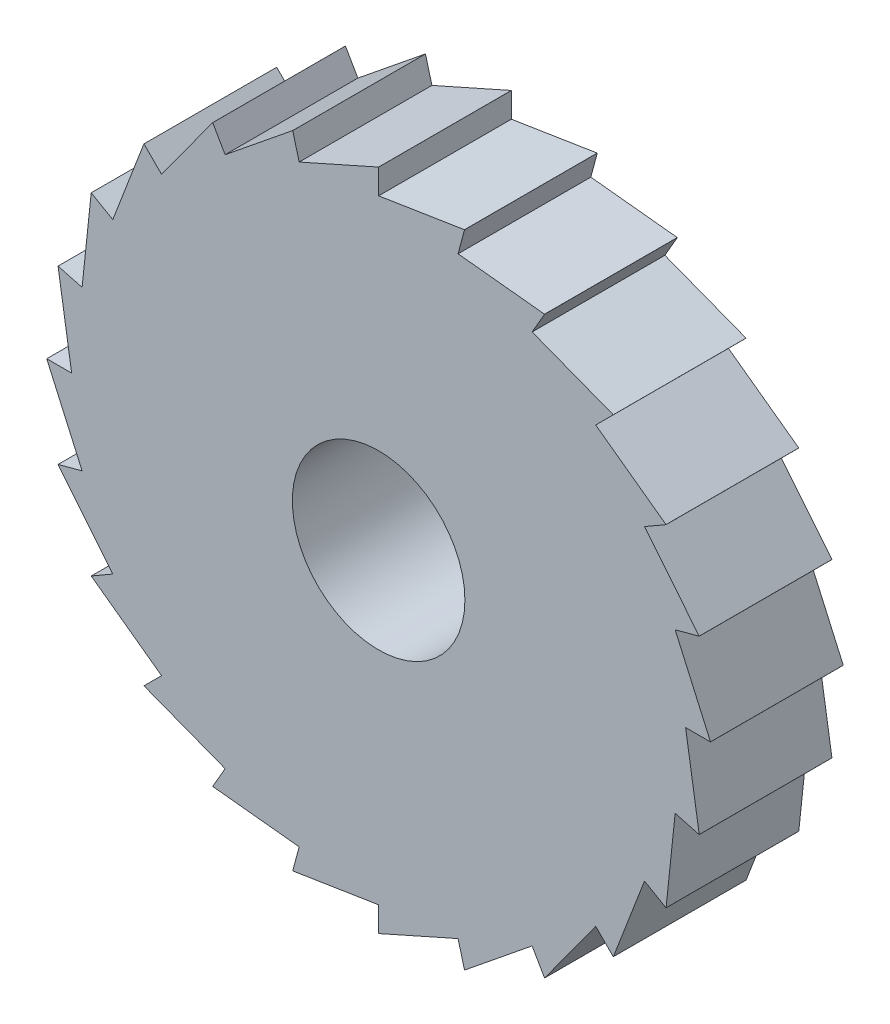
from build123d import *

# Parameters (mm, degrees)
SKETCH_2_R      = 6.5
EXTRUDE_2_DEPTH = 10


with BuildPart() as part:
    # Sketch 2 → Extrude 2 (new body)
    with BuildSketch(Plane.XY):
        with BuildLine():
            Line((0, 25), (0, 23.125))
            Line((0, 23.125), (6.466541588, 24.14919957))
            ThreePointArc((6.466541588, 24.14919957), (6.468508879, 24.148672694), (6.470476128, 24.148145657))
            Line((6.470476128, 24.148145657), (5.985190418, 22.337034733))
            Line((5.985190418, 22.337034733), (12.4964723, 21.65267143))
            ThreePointArc((12.4964723, 21.65267143), (12.498236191, 21.651653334), (12.5, 21.650635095))
            Line((12.5, 21.650635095), (11.5625, 20.026837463))
            Line((11.5625, 20.026837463), (17.674789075, 17.680549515))
            ThreePointArc((17.674789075, 17.680549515), (17.676229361, 17.679109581), (17.67766953, 17.67766953))
            Line((17.67766953, 17.67766953), (16.351844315, 16.351844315))
            Line((16.351844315, 16.351844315), (21.648598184, 12.503527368))
            ThreePointArc((21.648598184, 12.503527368), (21.649616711, 12.501763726), (21.650635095, 12.5))
            Line((21.650635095, 12.5), (20.026837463, 11.5625))
            Line((20.026837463, 11.5625), (24.147091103, 6.474410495))
            ThreePointArc((24.147091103, 6.474410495), (24.14761846, 6.472443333), (24.148145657, 6.470476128))
            Line((24.148145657, 6.470476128), (22.337034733, 5.985190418))
            Line((22.337034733, 5.985190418), (24.999999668, 0.004073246))
            ThreePointArc((24.999999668, 0.004073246), (24.999999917, 0.002036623), (25, 0))
            Line((25, 0), (23.125, 0))
            Line((23.125, 0), (24.14919957, -6.466541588))
            ThreePointArc((24.14919957, -6.466541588), (24.148672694, -6.468508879), (24.148145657, -6.470476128))
            Line((24.148145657, -6.470476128), (22.337034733, -5.985190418))
            Line((22.337034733, -5.985190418), (21.65267143, -12.4964723))
            ThreePointArc((21.65267143, -12.4964723), (21.651653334, -12.498236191), (21.650635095, -12.5))
            Line((21.650635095, -12.5), (20.026837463, -11.5625))
            Line((20.026837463, -11.5625), (17.680549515, -17.674789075))
            ThreePointArc((17.680549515, -17.674789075), (17.679109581, -17.676229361), (17.67766953, -17.67766953))
            Line((17.67766953, -17.67766953), (16.351844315, -16.351844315))
            Line((16.351844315, -16.351844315), (12.503527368, -21.648598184))
            ThreePointArc((12.503527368, -21.648598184), (12.501763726, -21.649616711), (12.5, -21.650635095))
            Line((12.5, -21.650635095), (11.5625, -20.026837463))
            Line((11.5625, -20.026837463), (6.474410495, -24.147091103))
            ThreePointArc((6.474410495, -24.147091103), (6.472443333, -24.14761846), (6.470476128, -24.148145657))
            Line((6.470476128, -24.148145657), (5.985190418, -22.337034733))
            Line((5.985190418, -22.337034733), (0.004073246, -24.999999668))
            ThreePointArc((0.004073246, -24.999999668), (0.002036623, -24.999999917), (0, -25))
            Line((0, -25), (0, -23.125))
            Line((0, -23.125), (-6.466541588, -24.14919957))
            ThreePointArc((-6.466541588, -24.14919957), (-6.468508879, -24.148672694), (-6.470476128, -24.148145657))
            Line((-6.470476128, -24.148145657), (-5.985190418, -22.337034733))
            Line((-5.985190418, -22.337034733), (-12.4964723, -21.65267143))
            ThreePointArc((-12.4964723, -21.65267143), (-12.498236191, -21.651653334), (-12.5, -21.650635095))
            Line((-12.5, -21.650635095), (-11.5625, -20.026837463))
            Line((-11.5625, -20.026837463), (-17.674789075, -17.680549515))
            ThreePointArc((-17.674789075, -17.680549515), (-17.676229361, -17.679109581), (-17.67766953, -17.67766953))
            Line((-17.67766953, -17.67766953), (-16.351844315, -16.351844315))
            Line((-16.351844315, -16.351844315), (-21.648598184, -12.503527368))
            ThreePointArc((-21.648598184, -12.503527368), (-21.649616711, -12.501763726), (-21.650635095, -12.5))
            Line((-21.650635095, -12.5), (-20.026837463, -11.5625))
            Line((-20.026837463, -11.5625), (-24.147091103, -6.474410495))
            ThreePointArc((-24.147091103, -6.474410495), (-24.14761846, -6.472443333), (-24.148145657, -6.470476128))
            Line((-24.148145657, -6.470476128), (-22.337034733, -5.985190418))
            Line((-22.337034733, -5.985190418), (-24.999999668, -0.004073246))
            ThreePointArc((-24.999999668, -0.004073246), (-24.999999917, -0.002036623), (-25, 0))
            Line((-25, 0), (-23.125, 0))
            Line((-23.125, 0), (-24.14919957, 6.466541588))
            ThreePointArc((-24.14919957, 6.466541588), (-24.148672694, 6.468508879), (-24.148145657, 6.470476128))
            Line((-24.148145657, 6.470476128), (-22.337034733, 5.985190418))
            Line((-22.337034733, 5.985190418), (-21.65267143, 12.4964723))
            ThreePointArc((-21.65267143, 12.4964723), (-21.651653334, 12.498236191), (-21.650635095, 12.5))
            Line((-21.650635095, 12.5), (-20.026837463, 11.5625))
            Line((-20.026837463, 11.5625), (-17.680549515, 17.674789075))
            ThreePointArc((-17.680549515, 17.674789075), (-17.679109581, 17.676229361), (-17.67766953, 17.67766953))
            Line((-17.67766953, 17.67766953), (-16.351844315, 16.351844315))
            Line((-16.351844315, 16.351844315), (-12.503527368, 21.648598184))
            ThreePointArc((-12.503527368, 21.648598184), (-12.501763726, 21.649616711), (-12.5, 21.650635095))
            Line((-12.5, 21.650635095), (-11.5625, 20.026837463))
            Line((-11.5625, 20.026837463), (-6.474410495, 24.147091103))
            ThreePointArc((-6.474410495, 24.147091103), (-6.472443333, 24.14761846), (-6.470476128, 24.148145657))
            Line((-6.470476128, 24.148145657), (-5.985190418, 22.337034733))
            Line((-5.985190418, 22.337034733), (-0.004073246, 24.999999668))
            ThreePointArc((-0.004073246, 24.999999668), (-0.002036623, 24.999999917), (0, 25))
        make_face()
        Circle(SKETCH_2_R, mode=Mode.SUBTRACT)
    extrude(amount=EXTRUDE_2_DEPTH)


solid = part.part
